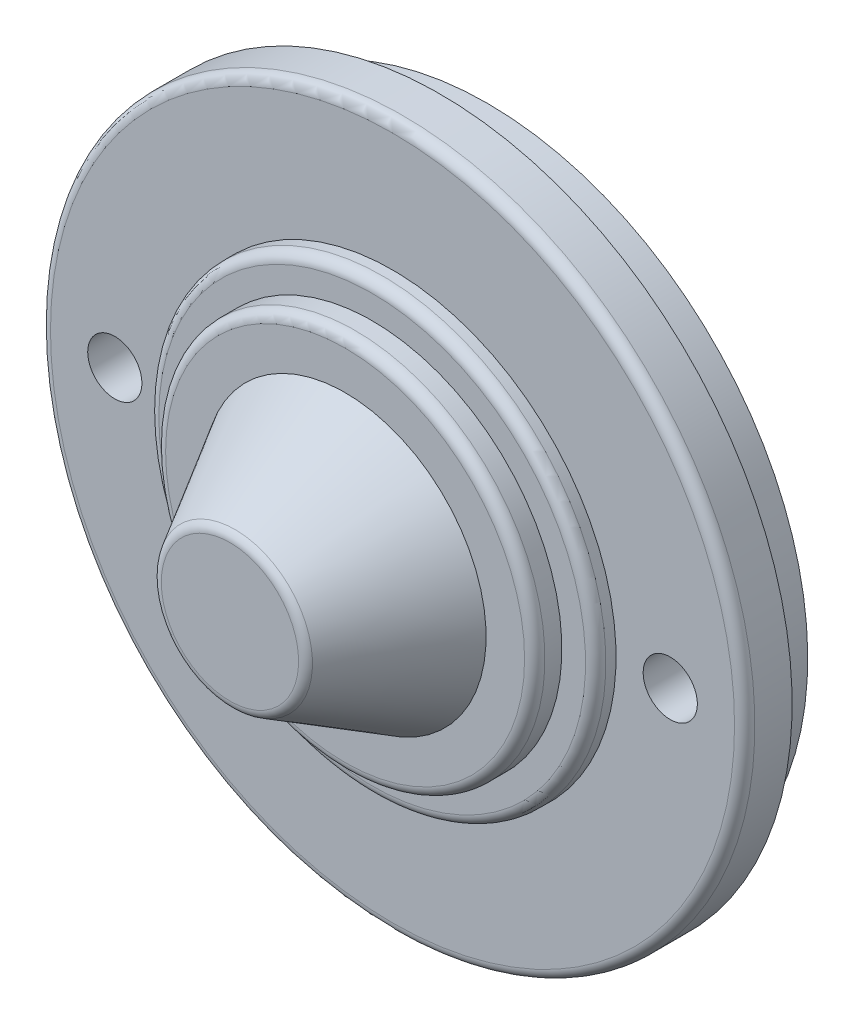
from build123d import *

# Parameters (mm, degrees)
ESQUISSE3_R             = 3
BOSS_EXTRU_1_DEPTH      = 3.5
ESQUISSE4_R             = 2
ENL_V_MAT_EXTRU_1_DEPTH = 60.166528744
ENL_V_MAT_EXTRU_2_DEPTH = 3.5


with BuildPart() as part:
    # Esquisse2 → Base-R_volution (revolve)
    with BuildSketch(Plane.ZY, mode=Mode.PRIVATE) as base_r_volution_sk:
        with BuildLine():
            Line((-8.136326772, 47.288365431), (-4.636326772, 47.288365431))
            Line((-4.636326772, 47.288365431), (-4.636326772, 49.636453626))
            Line((-4.636326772, 49.636453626), (-1.886326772, 49.636453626))
            ThreePointArc((-1.886326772, 49.636453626), (-1.355996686, 49.416783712), (-1.136326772, 48.886453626))
            Line((-1.136326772, 48.886453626), (-1.136326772, 40.138365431))
            Line((-1.136326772, 40.138365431), (-0.386326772, 40.138365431))
            ThreePointArc((-0.386326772, 40.138365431), (0.144003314, 39.918695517), (0.363673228, 39.388365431))
            Line((0.363673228, 39.388365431), (0.363673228, 37.638365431))
            Line((0.363673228, 37.638365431), (1.613673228, 37.638365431))
            ThreePointArc((1.613673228, 37.638365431), (2.144003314, 37.418695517), (2.363673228, 36.888365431))
            Line((2.363673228, 36.888365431), (2.363673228, 34.045842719))
            Line((2.363673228, 34.045842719), (10.488673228, 29.354871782))
            ThreePointArc((10.488673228, 29.354871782), (10.763192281, 29.080352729), (10.863673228, 28.705352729))
            Line((10.863673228, 28.705352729), (10.863673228, 23.638365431))
            Line((10.863673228, 23.638365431), (8.563673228, 23.638365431))
            Line((8.563673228, 23.638365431), (8.563673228, 27.906314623))
            Line((8.563673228, 27.906314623), (5.563673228, 29.638365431))
            Line((5.563673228, 29.638365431), (-3.436326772, 29.638365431))
            Line((-3.436326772, 29.638365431), (-3.436326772, 37.138365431))
            Line((-3.436326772, 37.138365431), (-6.836326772, 37.138365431))
            Line((-6.836326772, 37.138365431), (-6.836326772, 38.888365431))
            ThreePointArc((-6.836326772, 38.888365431), (-6.616656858, 39.418695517), (-6.086326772, 39.638365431))
            Line((-6.086326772, 39.638365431), (-4.636326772, 39.638365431))
            Line((-4.636326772, 39.638365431), (-4.636326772, 45.588365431))
            Line((-4.636326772, 45.588365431), (-8.136326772, 45.588365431))
            Line((-8.136326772, 45.588365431), (-8.136326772, 47.288365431))
        make_face()
    revolve(base_r_volution_sk.sketch.rotate(Axis((0, 23.638365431, -29.0601227), (0, 0, 1)), 90), axis=Axis((0, 23.638365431, -29.0601227), (0, 0, 1)))

    # Esquisse3 → Boss.-Extru.1 (add)
    with BuildSketch(Plane(origin=(0, 0, -4.636326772), x_dir=(-1, 0, 0), z_dir=(0, 0, -1))):
        with Locations((20.5, 23.638365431)):
            Circle(ESQUISSE3_R)
        with Locations((-20.5, 23.638365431)):
            Circle(ESQUISSE3_R)
    extrude(amount=BOSS_EXTRU_1_DEPTH)

    # Esquisse4 → Enl_v. mat.-Extru.1 (cut, through all)
    with BuildSketch(Plane(origin=(0, 0, -8.136326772), x_dir=(-1, 0, 0), z_dir=(0, 0, -1))):
        with Locations((20.5, 23.638365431)):
            Circle(ESQUISSE4_R)
        with Locations((-20.5, 23.638365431)):
            Circle(ESQUISSE4_R)
    extrude(amount=-ENL_V_MAT_EXTRU_1_DEPTH, mode=Mode.SUBTRACT)

    # Esquisse5 → Enl_v. mat.-Extru.2 (cut)
    with BuildSketch(Plane(origin=(0, 0, -8.136326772), x_dir=(-1, 0, 0), z_dir=(0, 0, -1))):
        with BuildLine():
            Line((21.870585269, 32.638365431), (20.020052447, 32.638365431))
            ThreePointArc((20.020052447, 32.638365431), (21.025673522, 29.941027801), (21.669657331, 27.135285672))
            Line((21.669657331, 27.135285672), (23.309279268, 27.638365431))
            ThreePointArc((23.309279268, 27.638365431), (22.727847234, 30.178048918), (21.870585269, 32.638365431))
        make_face()
    extrude(amount=-ENL_V_MAT_EXTRU_2_DEPTH, mode=Mode.SUBTRACT)


solid = part.part
